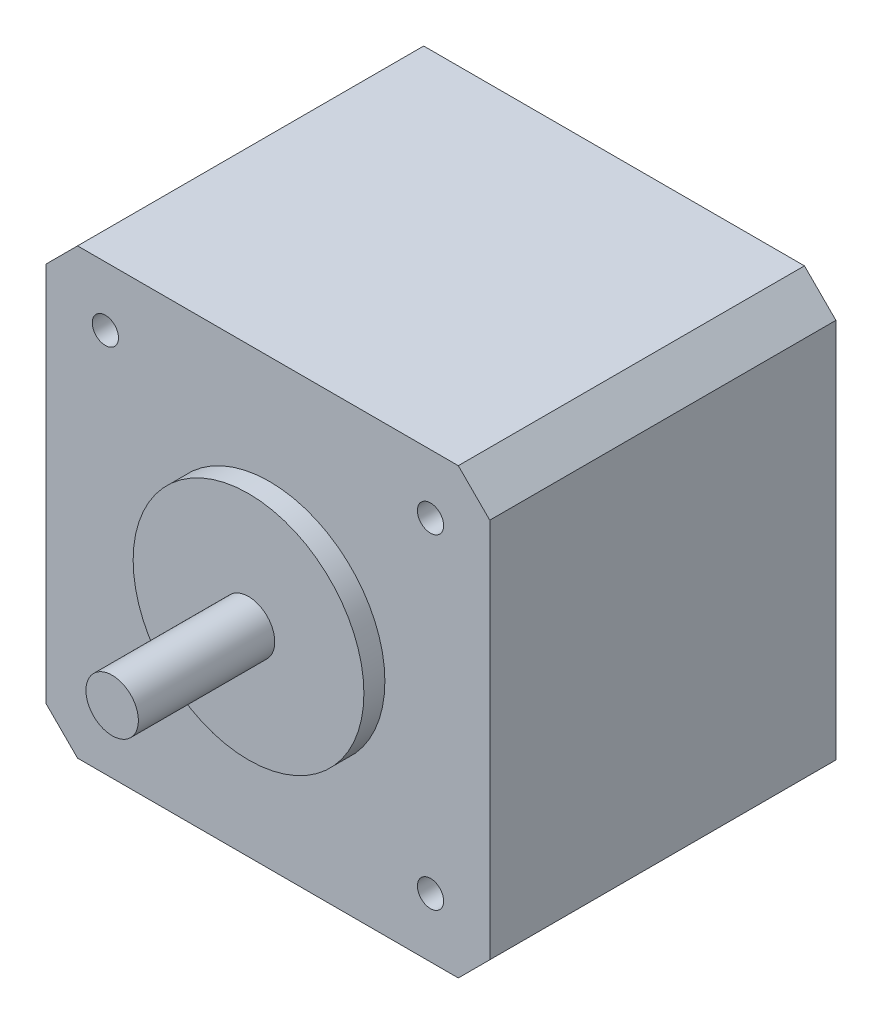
ISO-10303-21;
HEADER;
FILE_DESCRIPTION(('STEP AP214'),'2;1');
FILE_NAME('part.step','',(''),(''),'','','');
FILE_SCHEMA(('AUTOMOTIVE_DESIGN { 1 0 10303 214 1 1 1 1 }'));
ENDSEC;
DATA;
#1=APPLICATION_CONTEXT('core data for automotive mechanical design processes');
#2=APPLICATION_PROTOCOL_DEFINITION('international standard','automotive_design',2000,#1);
#3=PRODUCT_CONTEXT('',#1,'mechanical');
#4=PRODUCT('Part','Part','',(#3));
#5=PRODUCT_RELATED_PRODUCT_CATEGORY('part','',(#4));
#6=PRODUCT_DEFINITION_FORMATION('','',#4);
#7=PRODUCT_DEFINITION_CONTEXT('part definition',#1,'design');
#8=PRODUCT_DEFINITION('design','',#6,#7);
#9=PRODUCT_DEFINITION_SHAPE('','',#8);
#10=(LENGTH_UNIT() NAMED_UNIT(*) SI_UNIT(.MILLI.,.METRE.));
#11=(NAMED_UNIT(*) PLANE_ANGLE_UNIT() SI_UNIT($,.RADIAN.));
#12=(NAMED_UNIT(*) SI_UNIT($,.STERADIAN.) SOLID_ANGLE_UNIT());
#13=UNCERTAINTY_MEASURE_WITH_UNIT(LENGTH_MEASURE(1.E-05),#10,'distance_accuracy_value','');
#14=(GEOMETRIC_REPRESENTATION_CONTEXT(3) GLOBAL_UNCERTAINTY_ASSIGNED_CONTEXT((#13)) GLOBAL_UNIT_ASSIGNED_CONTEXT((#10,
#11,#12)) REPRESENTATION_CONTEXT('',''));
#15=CARTESIAN_POINT('',(0.,0.,0.));
#16=DIRECTION('',(0.,0.,1.));
#17=DIRECTION('',(1.,0.,0.));
#18=AXIS2_PLACEMENT_3D('',#15,#16,#17);
#19=CARTESIAN_POINT('',(0.,0.,0.));
#20=DIRECTION('',(1.,0.,0.));
#21=DIRECTION('',(0.,0.,-1.));
#22=AXIS2_PLACEMENT_3D('',#19,#20,#21);
#23=PLANE('',#22);
#24=DIRECTION('',(0.,1.,0.));
#25=VECTOR('',#24,1.);
#26=CARTESIAN_POINT('',(0.,0.,0.));
#27=LINE('',#26,#25);
#28=CARTESIAN_POINT('',(0.,3.00000000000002,0.));
#29=VERTEX_POINT('',#28);
#30=CARTESIAN_POINT('',(0.,39.3,0.));
#31=VERTEX_POINT('',#30);
#32=EDGE_CURVE('E155',#29,#31,#27,.T.);
#33=ORIENTED_EDGE('',*,*,#32,.T.);
#34=DIRECTION('',(0.,0.,1.));
#35=VECTOR('',#34,1.);
#36=CARTESIAN_POINT('',(0.,39.3,0.));
#37=LINE('',#36,#35);
#38=CARTESIAN_POINT('',(0.,39.3,33.));
#39=VERTEX_POINT('',#38);
#40=EDGE_CURVE('E11',#31,#39,#37,.T.);
#41=ORIENTED_EDGE('',*,*,#40,.T.);
#42=DIRECTION('',(0.,1.,0.));
#43=VECTOR('',#42,1.);
#44=CARTESIAN_POINT('',(0.,0.,33.));
#45=LINE('',#44,#43);
#46=CARTESIAN_POINT('',(0.,3.00000000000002,33.));
#47=VERTEX_POINT('',#46);
#48=EDGE_CURVE('E106',#47,#39,#45,.T.);
#49=ORIENTED_EDGE('',*,*,#48,.F.);
#50=DIRECTION('',(0.,0.,-1.));
#51=VECTOR('',#50,1.);
#52=CARTESIAN_POINT('',(0.,3.00000000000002,0.));
#53=LINE('',#52,#51);
#54=EDGE_CURVE('E42',#47,#29,#53,.T.);
#55=ORIENTED_EDGE('',*,*,#54,.T.);
#56=EDGE_LOOP('',(#33,#41,#49,#55));
#57=FACE_BOUND('',#56,.T.);
#58=ADVANCED_FACE('F34',(#57),#23,.T.);
#59=CARTESIAN_POINT('',(-42.3,0.,0.));
#60=DIRECTION('',(0.,-1.,0.));
#61=DIRECTION('',(1.,0.,0.));
#62=AXIS2_PLACEMENT_3D('',#59,#60,#61);
#63=PLANE('',#62);
#64=DIRECTION('',(1.,0.,0.));
#65=VECTOR('',#64,1.);
#66=CARTESIAN_POINT('',(-42.3,0.,33.));
#67=LINE('',#66,#65);
#68=CARTESIAN_POINT('',(-39.3,0.,33.));
#69=VERTEX_POINT('',#68);
#70=CARTESIAN_POINT('',(-3.,0.,33.));
#71=VERTEX_POINT('',#70);
#72=EDGE_CURVE('E160',#69,#71,#67,.T.);
#73=ORIENTED_EDGE('',*,*,#72,.F.);
#74=DIRECTION('',(0.,0.,-1.));
#75=VECTOR('',#74,1.);
#76=CARTESIAN_POINT('',(-39.3,0.,0.));
#77=LINE('',#76,#75);
#78=CARTESIAN_POINT('',(-39.3,0.,0.));
#79=VERTEX_POINT('',#78);
#80=EDGE_CURVE('E56',#69,#79,#77,.T.);
#81=ORIENTED_EDGE('',*,*,#80,.T.);
#82=DIRECTION('',(1.,0.,0.));
#83=VECTOR('',#82,1.);
#84=CARTESIAN_POINT('',(-42.3,0.,0.));
#85=LINE('',#84,#83);
#86=CARTESIAN_POINT('',(-3.,0.,0.));
#87=VERTEX_POINT('',#86);
#88=EDGE_CURVE('E130',#79,#87,#85,.T.);
#89=ORIENTED_EDGE('',*,*,#88,.T.);
#90=DIRECTION('',(0.,0.,1.));
#91=VECTOR('',#90,1.);
#92=CARTESIAN_POINT('',(-3.,0.,0.));
#93=LINE('',#92,#91);
#94=EDGE_CURVE('E149',#87,#71,#93,.T.);
#95=ORIENTED_EDGE('',*,*,#94,.T.);
#96=EDGE_LOOP('',(#73,#81,#89,#95));
#97=FACE_BOUND('',#96,.T.);
#98=ADVANCED_FACE('F164',(#97),#63,.T.);
#99=CARTESIAN_POINT('',(-42.3,42.3,0.));
#100=DIRECTION('',(-1.,0.,0.));
#101=DIRECTION('',(0.,0.,1.));
#102=AXIS2_PLACEMENT_3D('',#99,#100,#101);
#103=PLANE('',#102);
#104=DIRECTION('',(0.,-1.,0.));
#105=VECTOR('',#104,1.);
#106=CARTESIAN_POINT('',(-42.3,42.3,33.));
#107=LINE('',#106,#105);
#108=CARTESIAN_POINT('',(-42.3,39.3,33.));
#109=VERTEX_POINT('',#108);
#110=CARTESIAN_POINT('',(-42.3,2.99999999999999,33.));
#111=VERTEX_POINT('',#110);
#112=EDGE_CURVE('E121',#109,#111,#107,.T.);
#113=ORIENTED_EDGE('',*,*,#112,.F.);
#114=DIRECTION('',(0.,0.,-1.));
#115=VECTOR('',#114,1.);
#116=CARTESIAN_POINT('',(-42.3,39.3,0.));
#117=LINE('',#116,#115);
#118=CARTESIAN_POINT('',(-42.3,39.3,0.));
#119=VERTEX_POINT('',#118);
#120=EDGE_CURVE('E141',#109,#119,#117,.T.);
#121=ORIENTED_EDGE('',*,*,#120,.T.);
#122=DIRECTION('',(0.,-1.,0.));
#123=VECTOR('',#122,1.);
#124=CARTESIAN_POINT('',(-42.3,42.3,0.));
#125=LINE('',#124,#123);
#126=CARTESIAN_POINT('',(-42.3,2.99999999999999,0.));
#127=VERTEX_POINT('',#126);
#128=EDGE_CURVE('E171',#119,#127,#125,.T.);
#129=ORIENTED_EDGE('',*,*,#128,.T.);
#130=DIRECTION('',(0.,0.,1.));
#131=VECTOR('',#130,1.);
#132=CARTESIAN_POINT('',(-42.3,2.99999999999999,0.));
#133=LINE('',#132,#131);
#134=EDGE_CURVE('E138',#127,#111,#133,.T.);
#135=ORIENTED_EDGE('',*,*,#134,.T.);
#136=EDGE_LOOP('',(#113,#121,#129,#135));
#137=FACE_BOUND('',#136,.T.);
#138=ADVANCED_FACE('F242',(#137),#103,.T.);
#139=CARTESIAN_POINT('',(0.,42.3,0.));
#140=DIRECTION('',(0.,1.,0.));
#141=DIRECTION('',(0.,0.,1.));
#142=AXIS2_PLACEMENT_3D('',#139,#140,#141);
#143=PLANE('',#142);
#144=DIRECTION('',(-1.,0.,0.));
#145=VECTOR('',#144,1.);
#146=CARTESIAN_POINT('',(0.,42.3,0.));
#147=LINE('',#146,#145);
#148=CARTESIAN_POINT('',(-3.00000000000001,42.3,0.));
#149=VERTEX_POINT('',#148);
#150=CARTESIAN_POINT('',(-39.3,42.3,0.));
#151=VERTEX_POINT('',#150);
#152=EDGE_CURVE('E159',#149,#151,#147,.T.);
#153=ORIENTED_EDGE('',*,*,#152,.T.);
#154=DIRECTION('',(0.,0.,1.));
#155=VECTOR('',#154,1.);
#156=CARTESIAN_POINT('',(-39.3,42.3,0.));
#157=LINE('',#156,#155);
#158=CARTESIAN_POINT('',(-39.3,42.3,33.));
#159=VERTEX_POINT('',#158);
#160=EDGE_CURVE('E120',#151,#159,#157,.T.);
#161=ORIENTED_EDGE('',*,*,#160,.T.);
#162=DIRECTION('',(-1.,0.,0.));
#163=VECTOR('',#162,1.);
#164=CARTESIAN_POINT('',(0.,42.3,33.));
#165=LINE('',#164,#163);
#166=CARTESIAN_POINT('',(-3.00000000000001,42.3,33.));
#167=VERTEX_POINT('',#166);
#168=EDGE_CURVE('E104',#167,#159,#165,.T.);
#169=ORIENTED_EDGE('',*,*,#168,.F.);
#170=DIRECTION('',(0.,0.,-1.));
#171=VECTOR('',#170,1.);
#172=CARTESIAN_POINT('',(-3.00000000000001,42.3,0.));
#173=LINE('',#172,#171);
#174=EDGE_CURVE('E117',#167,#149,#173,.T.);
#175=ORIENTED_EDGE('',*,*,#174,.T.);
#176=EDGE_LOOP('',(#153,#161,#169,#175));
#177=FACE_BOUND('',#176,.T.);
#178=ADVANCED_FACE('F116',(#177),#143,.T.);
#179=CARTESIAN_POINT('',(0.,0.,0.));
#180=DIRECTION('',(0.,0.,1.));
#181=DIRECTION('',(1.,0.,0.));
#182=AXIS2_PLACEMENT_3D('',#179,#180,#181);
#183=PLANE('',#182);
#184=ORIENTED_EDGE('',*,*,#128,.F.);
#185=DIRECTION('',(-0.707106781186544,-0.707106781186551,0.));
#186=VECTOR('',#185,1.);
#187=CARTESIAN_POINT('',(-39.3,42.3,0.));
#188=LINE('',#187,#186);
#189=EDGE_CURVE('E147',#119,#151,#188,.F.);
#190=ORIENTED_EDGE('',*,*,#189,.T.);
#191=ORIENTED_EDGE('',*,*,#152,.F.);
#192=DIRECTION('',(-0.707106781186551,0.707106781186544,0.));
#193=VECTOR('',#192,1.);
#194=CARTESIAN_POINT('',(0.,39.3,0.));
#195=LINE('',#194,#193);
#196=EDGE_CURVE('E125',#149,#31,#195,.F.);
#197=ORIENTED_EDGE('',*,*,#196,.T.);
#198=ORIENTED_EDGE('',*,*,#32,.F.);
#199=DIRECTION('',(0.707106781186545,0.70710678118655,0.));
#200=VECTOR('',#199,1.);
#201=CARTESIAN_POINT('',(-3.,0.,0.));
#202=LINE('',#201,#200);
#203=EDGE_CURVE('E49',#29,#87,#202,.F.);
#204=ORIENTED_EDGE('',*,*,#203,.T.);
#205=ORIENTED_EDGE('',*,*,#88,.F.);
#206=DIRECTION('',(0.707106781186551,-0.707106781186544,0.));
#207=VECTOR('',#206,1.);
#208=CARTESIAN_POINT('',(-42.3,2.99999999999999,0.));
#209=LINE('',#208,#207);
#210=EDGE_CURVE('E145',#79,#127,#209,.F.);
#211=ORIENTED_EDGE('',*,*,#210,.T.);
#212=EDGE_LOOP('',(#184,#190,#191,#197,#198,#204,#205,#211));
#213=FACE_BOUND('',#212,.T.);
#214=ADVANCED_FACE('F158',(#213),#183,.F.);
#215=CARTESIAN_POINT('',(0.,0.,33.));
#216=DIRECTION('',(0.,0.,1.));
#217=DIRECTION('',(1.,0.,0.));
#218=AXIS2_PLACEMENT_3D('',#215,#216,#217);
#219=PLANE('',#218);
#220=CARTESIAN_POINT('',(-36.65,5.65,33.));
#221=DIRECTION('',(0.,0.,1.));
#222=DIRECTION('',(1.,0.,0.));
#223=AXIS2_PLACEMENT_3D('',#220,#221,#222);
#224=CIRCLE('',#223,1.24999999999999);
#225=CARTESIAN_POINT('',(-35.4,5.65,33.));
#226=VERTEX_POINT('',#225);
#227=EDGE_CURVE('E204',#226,#226,#224,.T.);
#228=ORIENTED_EDGE('',*,*,#227,.F.);
#229=EDGE_LOOP('',(#228));
#230=FACE_BOUND('',#229,.T.);
#231=CARTESIAN_POINT('',(-5.65,36.65,33.));
#232=DIRECTION('',(0.,0.,1.));
#233=DIRECTION('',(1.,0.,0.));
#234=AXIS2_PLACEMENT_3D('',#231,#232,#233);
#235=CIRCLE('',#234,1.24999999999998);
#236=CARTESIAN_POINT('',(-4.40000000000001,36.65,33.));
#237=VERTEX_POINT('',#236);
#238=EDGE_CURVE('E198',#237,#237,#235,.T.);
#239=ORIENTED_EDGE('',*,*,#238,.F.);
#240=EDGE_LOOP('',(#239));
#241=FACE_BOUND('',#240,.T.);
#242=CARTESIAN_POINT('',(-5.65,5.65,33.));
#243=DIRECTION('',(0.,0.,1.));
#244=DIRECTION('',(1.,0.,0.));
#245=AXIS2_PLACEMENT_3D('',#242,#243,#244);
#246=CIRCLE('',#245,1.24999999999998);
#247=CARTESIAN_POINT('',(-4.40000000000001,5.65,33.));
#248=VERTEX_POINT('',#247);
#249=EDGE_CURVE('E192',#248,#248,#246,.T.);
#250=ORIENTED_EDGE('',*,*,#249,.F.);
#251=EDGE_LOOP('',(#250));
#252=FACE_BOUND('',#251,.T.);
#253=CARTESIAN_POINT('',(-36.65,36.65,33.));
#254=DIRECTION('',(0.,0.,1.));
#255=DIRECTION('',(1.,0.,0.));
#256=AXIS2_PLACEMENT_3D('',#253,#254,#255);
#257=CIRCLE('',#256,1.24999999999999);
#258=CARTESIAN_POINT('',(-35.4,36.65,33.));
#259=VERTEX_POINT('',#258);
#260=EDGE_CURVE('E186',#259,#259,#257,.T.);
#261=ORIENTED_EDGE('',*,*,#260,.F.);
#262=EDGE_LOOP('',(#261));
#263=FACE_BOUND('',#262,.T.);
#264=CARTESIAN_POINT('',(-21.,21.,33.));
#265=DIRECTION('',(0.,0.,1.));
#266=DIRECTION('',(1.,0.,0.));
#267=AXIS2_PLACEMENT_3D('',#264,#265,#266);
#268=CIRCLE('',#267,11.);
#269=CARTESIAN_POINT('',(-10.,21.,33.));
#270=VERTEX_POINT('',#269);
#271=EDGE_CURVE('E126',#270,#270,#268,.T.);
#272=ORIENTED_EDGE('',*,*,#271,.F.);
#273=EDGE_LOOP('',(#272));
#274=FACE_BOUND('',#273,.T.);
#275=ORIENTED_EDGE('',*,*,#168,.T.);
#276=DIRECTION('',(0.707106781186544,0.707106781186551,0.));
#277=VECTOR('',#276,1.);
#278=CARTESIAN_POINT('',(-40.8000000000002,40.7999999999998,33.));
#279=LINE('',#278,#277);
#280=EDGE_CURVE('E136',#159,#109,#279,.F.);
#281=ORIENTED_EDGE('',*,*,#280,.T.);
#282=ORIENTED_EDGE('',*,*,#112,.T.);
#283=DIRECTION('',(-0.707106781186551,0.707106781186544,0.));
#284=VECTOR('',#283,1.);
#285=CARTESIAN_POINT('',(-19.6499999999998,-19.65,33.));
#286=LINE('',#285,#284);
#287=EDGE_CURVE('E110',#111,#69,#286,.F.);
#288=ORIENTED_EDGE('',*,*,#287,.T.);
#289=ORIENTED_EDGE('',*,*,#72,.T.);
#290=DIRECTION('',(-0.707106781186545,-0.70710678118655,0.));
#291=VECTOR('',#290,1.);
#292=CARTESIAN_POINT('',(-1.50000000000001,1.5,33.));
#293=LINE('',#292,#291);
#294=EDGE_CURVE('E111',#71,#47,#293,.F.);
#295=ORIENTED_EDGE('',*,*,#294,.T.);
#296=ORIENTED_EDGE('',*,*,#48,.T.);
#297=DIRECTION('',(0.707106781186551,-0.707106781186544,0.));
#298=VECTOR('',#297,1.);
#299=CARTESIAN_POINT('',(19.65,19.6500000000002,33.));
#300=LINE('',#299,#298);
#301=EDGE_CURVE('E101',#39,#167,#300,.F.);
#302=ORIENTED_EDGE('',*,*,#301,.T.);
#303=EDGE_LOOP('',(#275,#281,#282,#288,#289,#295,#296,#302));
#304=FACE_BOUND('',#303,.T.);
#305=ADVANCED_FACE('F103',(#230,#241,#252,#263,#274,#304),#219,.T.);
#306=CARTESIAN_POINT('',(-21.,21.,48.));
#307=DIRECTION('',(0.,0.,-1.));
#308=DIRECTION('',(-1.,0.,0.));
#309=AXIS2_PLACEMENT_3D('',#306,#307,#308);
#310=CYLINDRICAL_SURFACE('',#309,2.5);
#311=CARTESIAN_POINT('',(-21.,21.,48.));
#312=DIRECTION('',(0.,0.,-1.));
#313=DIRECTION('',(-1.,0.,0.));
#314=AXIS2_PLACEMENT_3D('',#311,#312,#313);
#315=CIRCLE('',#314,2.5);
#316=CARTESIAN_POINT('',(-23.5,21.,48.));
#317=VERTEX_POINT('',#316);
#318=EDGE_CURVE('E169',#317,#317,#315,.T.);
#319=ORIENTED_EDGE('',*,*,#318,.T.);
#320=EDGE_LOOP('',(#319));
#321=FACE_BOUND('',#320,.T.);
#322=CARTESIAN_POINT('',(-21.,21.,35.));
#323=DIRECTION('',(0.,0.,-1.));
#324=DIRECTION('',(-1.,0.,0.));
#325=AXIS2_PLACEMENT_3D('',#322,#323,#324);
#326=CIRCLE('',#325,2.5);
#327=CARTESIAN_POINT('',(-23.5,21.,35.));
#328=VERTEX_POINT('',#327);
#329=EDGE_CURVE('E180',#328,#328,#326,.T.);
#330=ORIENTED_EDGE('',*,*,#329,.F.);
#331=EDGE_LOOP('',(#330));
#332=FACE_BOUND('',#331,.T.);
#333=ADVANCED_FACE('F212',(#321,#332),#310,.T.);
#334=CARTESIAN_POINT('',(-18.5,21.,48.));
#335=DIRECTION('',(0.,0.,1.));
#336=DIRECTION('',(1.,0.,0.));
#337=AXIS2_PLACEMENT_3D('',#334,#335,#336);
#338=PLANE('',#337);
#339=ORIENTED_EDGE('',*,*,#318,.F.);
#340=EDGE_LOOP('',(#339));
#341=FACE_BOUND('',#340,.T.);
#342=ADVANCED_FACE('F225',(#341),#338,.T.);
#343=CARTESIAN_POINT('',(-21.,21.,48.));
#344=DIRECTION('',(0.,0.,-1.));
#345=DIRECTION('',(-1.,0.,0.));
#346=AXIS2_PLACEMENT_3D('',#343,#344,#345);
#347=CYLINDRICAL_SURFACE('',#346,11.);
#348=CARTESIAN_POINT('',(-21.,21.,35.));
#349=DIRECTION('',(0.,0.,-1.));
#350=DIRECTION('',(-1.,0.,0.));
#351=AXIS2_PLACEMENT_3D('',#348,#349,#350);
#352=CIRCLE('',#351,11.);
#353=CARTESIAN_POINT('',(-32.,21.,35.));
#354=VERTEX_POINT('',#353);
#355=EDGE_CURVE('E177',#354,#354,#352,.T.);
#356=ORIENTED_EDGE('',*,*,#355,.T.);
#357=EDGE_LOOP('',(#356));
#358=FACE_BOUND('',#357,.T.);
#359=ORIENTED_EDGE('',*,*,#271,.T.);
#360=EDGE_LOOP('',(#359));
#361=FACE_BOUND('',#360,.T.);
#362=ADVANCED_FACE('F222',(#358,#361),#347,.T.);
#363=CARTESIAN_POINT('',(-10.,21.,35.));
#364=DIRECTION('',(0.,0.,1.));
#365=DIRECTION('',(1.,0.,0.));
#366=AXIS2_PLACEMENT_3D('',#363,#364,#365);
#367=PLANE('',#366);
#368=ORIENTED_EDGE('',*,*,#329,.T.);
#369=EDGE_LOOP('',(#368));
#370=FACE_BOUND('',#369,.T.);
#371=ORIENTED_EDGE('',*,*,#355,.F.);
#372=EDGE_LOOP('',(#371));
#373=FACE_BOUND('',#372,.T.);
#374=ADVANCED_FACE('F224',(#370,#373),#367,.T.);
#375=CARTESIAN_POINT('',(-36.65,36.65,28.));
#376=DIRECTION('',(0.,0.,-1.));
#377=DIRECTION('',(-1.,0.,0.));
#378=AXIS2_PLACEMENT_3D('',#375,#376,#377);
#379=PLANE('',#378);
#380=CARTESIAN_POINT('',(-36.65,36.65,28.));
#381=DIRECTION('',(0.,0.,1.));
#382=DIRECTION('',(1.,0.,0.));
#383=AXIS2_PLACEMENT_3D('',#380,#381,#382);
#384=CIRCLE('',#383,1.24999999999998);
#385=CARTESIAN_POINT('',(-35.4,36.65,28.));
#386=VERTEX_POINT('',#385);
#387=EDGE_CURVE('E183',#386,#386,#384,.T.);
#388=ORIENTED_EDGE('',*,*,#387,.T.);
#389=EDGE_LOOP('',(#388));
#390=FACE_BOUND('',#389,.T.);
#391=ADVANCED_FACE('F232',(#390),#379,.F.);
#392=CARTESIAN_POINT('',(-36.65,36.65,33.));
#393=DIRECTION('',(0.,0.,1.));
#394=DIRECTION('',(1.,0.,0.));
#395=AXIS2_PLACEMENT_3D('',#392,#393,#394);
#396=CYLINDRICAL_SURFACE('',#395,1.24999999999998);
#397=ORIENTED_EDGE('',*,*,#387,.F.);
#398=EDGE_LOOP('',(#397));
#399=FACE_BOUND('',#398,.T.);
#400=ORIENTED_EDGE('',*,*,#260,.T.);
#401=EDGE_LOOP('',(#400));
#402=FACE_BOUND('',#401,.T.);
#403=ADVANCED_FACE('F376',(#399,#402),#396,.F.);
#404=CARTESIAN_POINT('',(-5.65,5.65,28.));
#405=DIRECTION('',(0.,0.,-1.));
#406=DIRECTION('',(-1.,0.,0.));
#407=AXIS2_PLACEMENT_3D('',#404,#405,#406);
#408=PLANE('',#407);
#409=CARTESIAN_POINT('',(-5.65,5.65,28.));
#410=DIRECTION('',(0.,0.,1.));
#411=DIRECTION('',(1.,0.,0.));
#412=AXIS2_PLACEMENT_3D('',#409,#410,#411);
#413=CIRCLE('',#412,1.24999999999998);
#414=CARTESIAN_POINT('',(-4.40000000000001,5.65,28.));
#415=VERTEX_POINT('',#414);
#416=EDGE_CURVE('E189',#415,#415,#413,.T.);
#417=ORIENTED_EDGE('',*,*,#416,.T.);
#418=EDGE_LOOP('',(#417));
#419=FACE_BOUND('',#418,.T.);
#420=ADVANCED_FACE('F366',(#419),#408,.F.);
#421=CARTESIAN_POINT('',(-5.65,5.65,33.));
#422=DIRECTION('',(0.,0.,1.));
#423=DIRECTION('',(1.,0.,0.));
#424=AXIS2_PLACEMENT_3D('',#421,#422,#423);
#425=CYLINDRICAL_SURFACE('',#424,1.24999999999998);
#426=ORIENTED_EDGE('',*,*,#416,.F.);
#427=EDGE_LOOP('',(#426));
#428=FACE_BOUND('',#427,.T.);
#429=ORIENTED_EDGE('',*,*,#249,.T.);
#430=EDGE_LOOP('',(#429));
#431=FACE_BOUND('',#430,.T.);
#432=ADVANCED_FACE('F356',(#428,#431),#425,.F.);
#433=CARTESIAN_POINT('',(-5.65,36.65,28.));
#434=DIRECTION('',(0.,0.,-1.));
#435=DIRECTION('',(-1.,0.,0.));
#436=AXIS2_PLACEMENT_3D('',#433,#434,#435);
#437=PLANE('',#436);
#438=CARTESIAN_POINT('',(-5.65,36.65,28.));
#439=DIRECTION('',(0.,0.,1.));
#440=DIRECTION('',(1.,0.,0.));
#441=AXIS2_PLACEMENT_3D('',#438,#439,#440);
#442=CIRCLE('',#441,1.24999999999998);
#443=CARTESIAN_POINT('',(-4.40000000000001,36.65,28.));
#444=VERTEX_POINT('',#443);
#445=EDGE_CURVE('E195',#444,#444,#442,.T.);
#446=ORIENTED_EDGE('',*,*,#445,.T.);
#447=EDGE_LOOP('',(#446));
#448=FACE_BOUND('',#447,.T.);
#449=ADVANCED_FACE('F346',(#448),#437,.F.);
#450=CARTESIAN_POINT('',(-5.65,36.65,33.));
#451=DIRECTION('',(0.,0.,1.));
#452=DIRECTION('',(1.,0.,0.));
#453=AXIS2_PLACEMENT_3D('',#450,#451,#452);
#454=CYLINDRICAL_SURFACE('',#453,1.24999999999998);
#455=ORIENTED_EDGE('',*,*,#445,.F.);
#456=EDGE_LOOP('',(#455));
#457=FACE_BOUND('',#456,.T.);
#458=ORIENTED_EDGE('',*,*,#238,.T.);
#459=EDGE_LOOP('',(#458));
#460=FACE_BOUND('',#459,.T.);
#461=ADVANCED_FACE('F336',(#457,#460),#454,.F.);
#462=CARTESIAN_POINT('',(-36.65,5.65,28.));
#463=DIRECTION('',(0.,0.,-1.));
#464=DIRECTION('',(-1.,0.,0.));
#465=AXIS2_PLACEMENT_3D('',#462,#463,#464);
#466=PLANE('',#465);
#467=CARTESIAN_POINT('',(-36.65,5.65,28.));
#468=DIRECTION('',(0.,0.,1.));
#469=DIRECTION('',(1.,0.,0.));
#470=AXIS2_PLACEMENT_3D('',#467,#468,#469);
#471=CIRCLE('',#470,1.24999999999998);
#472=CARTESIAN_POINT('',(-35.4,5.65,28.));
#473=VERTEX_POINT('',#472);
#474=EDGE_CURVE('E201',#473,#473,#471,.T.);
#475=ORIENTED_EDGE('',*,*,#474,.T.);
#476=EDGE_LOOP('',(#475));
#477=FACE_BOUND('',#476,.T.);
#478=ADVANCED_FACE('F326',(#477),#466,.F.);
#479=CARTESIAN_POINT('',(-36.65,5.65,33.));
#480=DIRECTION('',(0.,0.,1.));
#481=DIRECTION('',(1.,0.,0.));
#482=AXIS2_PLACEMENT_3D('',#479,#480,#481);
#483=CYLINDRICAL_SURFACE('',#482,1.24999999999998);
#484=ORIENTED_EDGE('',*,*,#474,.F.);
#485=EDGE_LOOP('',(#484));
#486=FACE_BOUND('',#485,.T.);
#487=ORIENTED_EDGE('',*,*,#227,.T.);
#488=EDGE_LOOP('',(#487));
#489=FACE_BOUND('',#488,.T.);
#490=ADVANCED_FACE('F208',(#486,#489),#483,.F.);
#491=CARTESIAN_POINT('',(-39.3,42.3,0.));
#492=DIRECTION('',(0.707106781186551,-0.707106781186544,0.));
#493=DIRECTION('',(0.,0.,1.));
#494=AXIS2_PLACEMENT_3D('',#491,#492,#493);
#495=PLANE('',#494);
#496=ORIENTED_EDGE('',*,*,#189,.F.);
#497=ORIENTED_EDGE('',*,*,#120,.F.);
#498=ORIENTED_EDGE('',*,*,#280,.F.);
#499=ORIENTED_EDGE('',*,*,#160,.F.);
#500=EDGE_LOOP('',(#496,#497,#498,#499));
#501=FACE_BOUND('',#500,.T.);
#502=ADVANCED_FACE('F247',(#501),#495,.F.);
#503=CARTESIAN_POINT('',(-42.3,2.99999999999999,0.));
#504=DIRECTION('',(0.707106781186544,0.707106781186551,0.));
#505=DIRECTION('',(0.,0.,1.));
#506=AXIS2_PLACEMENT_3D('',#503,#504,#505);
#507=PLANE('',#506);
#508=ORIENTED_EDGE('',*,*,#210,.F.);
#509=ORIENTED_EDGE('',*,*,#80,.F.);
#510=ORIENTED_EDGE('',*,*,#287,.F.);
#511=ORIENTED_EDGE('',*,*,#134,.F.);
#512=EDGE_LOOP('',(#508,#509,#510,#511));
#513=FACE_BOUND('',#512,.T.);
#514=ADVANCED_FACE('F250',(#513),#507,.F.);
#515=CARTESIAN_POINT('',(0.,39.3,0.));
#516=DIRECTION('',(-0.707106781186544,-0.707106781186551,0.));
#517=DIRECTION('',(0.,0.,1.));
#518=AXIS2_PLACEMENT_3D('',#515,#516,#517);
#519=PLANE('',#518);
#520=ORIENTED_EDGE('',*,*,#196,.F.);
#521=ORIENTED_EDGE('',*,*,#174,.F.);
#522=ORIENTED_EDGE('',*,*,#301,.F.);
#523=ORIENTED_EDGE('',*,*,#40,.F.);
#524=EDGE_LOOP('',(#520,#521,#522,#523));
#525=FACE_BOUND('',#524,.T.);
#526=ADVANCED_FACE('F124',(#525),#519,.F.);
#527=CARTESIAN_POINT('',(-3.,0.,0.));
#528=DIRECTION('',(-0.70710678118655,0.707106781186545,0.));
#529=DIRECTION('',(0.,0.,1.));
#530=AXIS2_PLACEMENT_3D('',#527,#528,#529);
#531=PLANE('',#530);
#532=ORIENTED_EDGE('',*,*,#203,.F.);
#533=ORIENTED_EDGE('',*,*,#54,.F.);
#534=ORIENTED_EDGE('',*,*,#294,.F.);
#535=ORIENTED_EDGE('',*,*,#94,.F.);
#536=EDGE_LOOP('',(#532,#533,#534,#535));
#537=FACE_BOUND('',#536,.T.);
#538=ADVANCED_FACE('F36',(#537),#531,.F.);
#539=CLOSED_SHELL('',(#58,#98,#138,#178,#214,#305,#333,#342,#362,#374,#391,#403,#420,#432,#449,
#461,#478,#490,#502,#514,#526,#538));
#540=MANIFOLD_SOLID_BREP('B2',#539);
#541=ADVANCED_BREP_SHAPE_REPRESENTATION('',(#18,#540),#14);
#542=SHAPE_DEFINITION_REPRESENTATION(#9,#541);
ENDSEC;
END-ISO-10303-21;
